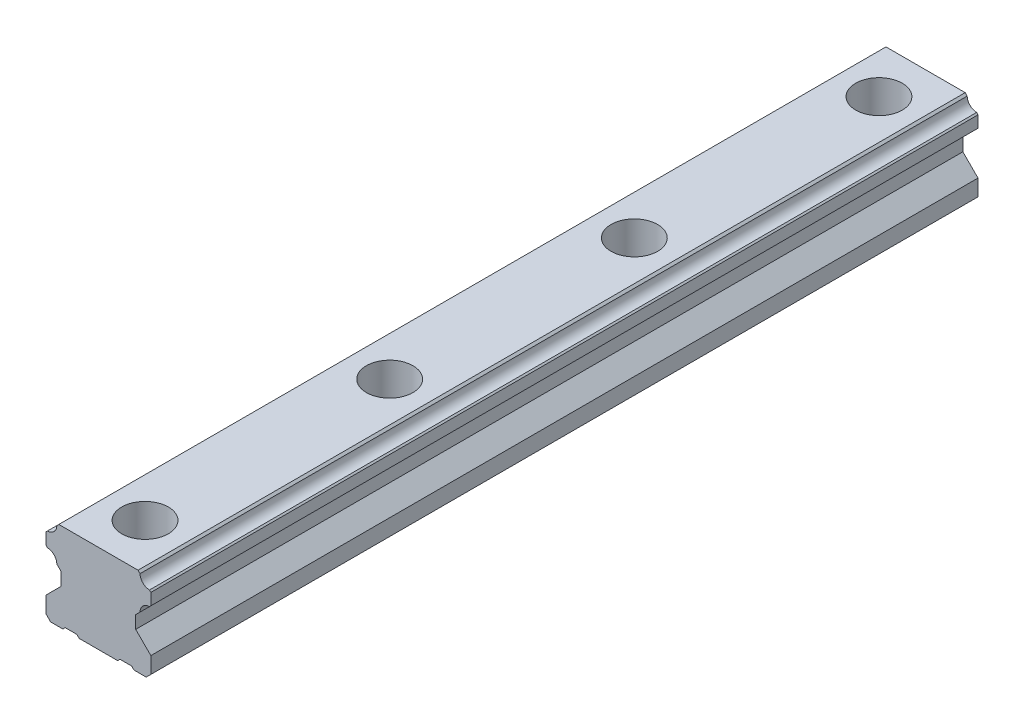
from build123d import *

# Parameters (mm, degrees)
BOSS_EXTRUDE1_DEPTH                                 = 177.5
CBORE_FOR_M4_HEX_SOCKET_HEAD_CAP_SCREW1_D           = 14
CBORE_FOR_M4_HEX_SOCKET_HEAD_CAP_SCREW1_CBORE_D     = 20
CBORE_FOR_M4_HEX_SOCKET_HEAD_CAP_SCREW1_CBORE_DEPTH = 17
LPATTERN1_COUNT                                     = 4
LPATTERN1_PITCH                                     = 105


with BuildPart() as part:
    # Sketch1 → Boss-Extrude1 (new, symmetric)
    with BuildSketch(Plane.XY):
        with BuildLine():
            Line((-17.859563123, 37.14106821), (-17.000631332, 38))
            Line((-17.000631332, 38), (17.000631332, 38))
            Line((17.000631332, 38), (17.859563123, 37.14106821))
            ThreePointArc((17.859563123, 37.14106821), (19.068417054, 34.301636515), (21.907847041, 33.092778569))
            Line((21.907847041, 33.092778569), (22.5, 32.500627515))
            Line((22.5, 32.500627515), (22.5, 27.497941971))
            Line((22.5, 27.497941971), (21.910303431, 26.908245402))
            ThreePointArc((21.910303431, 26.908245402), (19.068418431, 25.699341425), (17.859515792, 22.857455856))
            Line((17.859515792, 22.857455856), (16, 20.997941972))
            Line((16, 20.997941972), (16, 15.500781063))
            Line((16, 15.500781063), (22.5, 9.000761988))
            Line((22.5, 9.000761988), (22.5, 2))
            Line((22.5, 2), (20.5, 0))
            Line((20.5, 0), (15.25, 0))
            Line((15.25, 0), (14.25, 1))
            Line((14.25, 1), (9.25, 1))
            Line((9.25, 1), (8.25, 0))
            Line((8.25, 0), (-8.25, 0))
            Line((-8.25, 0), (-9.25, 1))
            Line((-9.25, 1), (-14.25, 1))
            Line((-14.25, 1), (-15.25, 0))
            Line((-15.25, 0), (-20.5, 0))
            Line((-20.5, 0), (-22.5, 2))
            Line((-22.5, 2), (-22.5, 9.000761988))
            Line((-22.5, 9.000761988), (-16, 15.500781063))
            Line((-16, 15.500781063), (-16, 20.997941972))
            Line((-16, 20.997941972), (-17.859515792, 22.857455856))
            ThreePointArc((-17.859515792, 22.857455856), (-19.068418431, 25.699341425), (-21.910303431, 26.908245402))
            Line((-21.910303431, 26.908245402), (-22.5, 27.497941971))
            Line((-22.5, 27.497941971), (-22.5, 32.500627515))
            Line((-22.5, 32.500627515), (-21.90784704, 33.092778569))
            ThreePointArc((-21.90784704, 33.092778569), (-19.068417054, 34.301636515), (-17.859563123, 37.14106821))
        make_face()
    extrude(amount=BOSS_EXTRUDE1_DEPTH, both=True)

    # CBORE for M4 Hex Socket Head Cap Screw1 (through all)
    with Locations(Plane(origin=(0, 38, 0), x_dir=(1, 0, 0), z_dir=(0, 1, 0))):
        with Locations((0, -157.5)):
            cbore_for_m4_hex_socket_head_cap_screw1 = CounterBoreHole(CBORE_FOR_M4_HEX_SOCKET_HEAD_CAP_SCREW1_D / 2, CBORE_FOR_M4_HEX_SOCKET_HEAD_CAP_SCREW1_CBORE_D / 2, CBORE_FOR_M4_HEX_SOCKET_HEAD_CAP_SCREW1_CBORE_DEPTH)

    # LPattern1: CBORE for M4 Hex Socket Head Cap Screw1 ×4
    with Locations(*[(0, 0, -i * LPATTERN1_PITCH) for i in range(1, LPATTERN1_COUNT)]):
        add(cbore_for_m4_hex_socket_head_cap_screw1, mode=Mode.SUBTRACT)


solid = part.part
